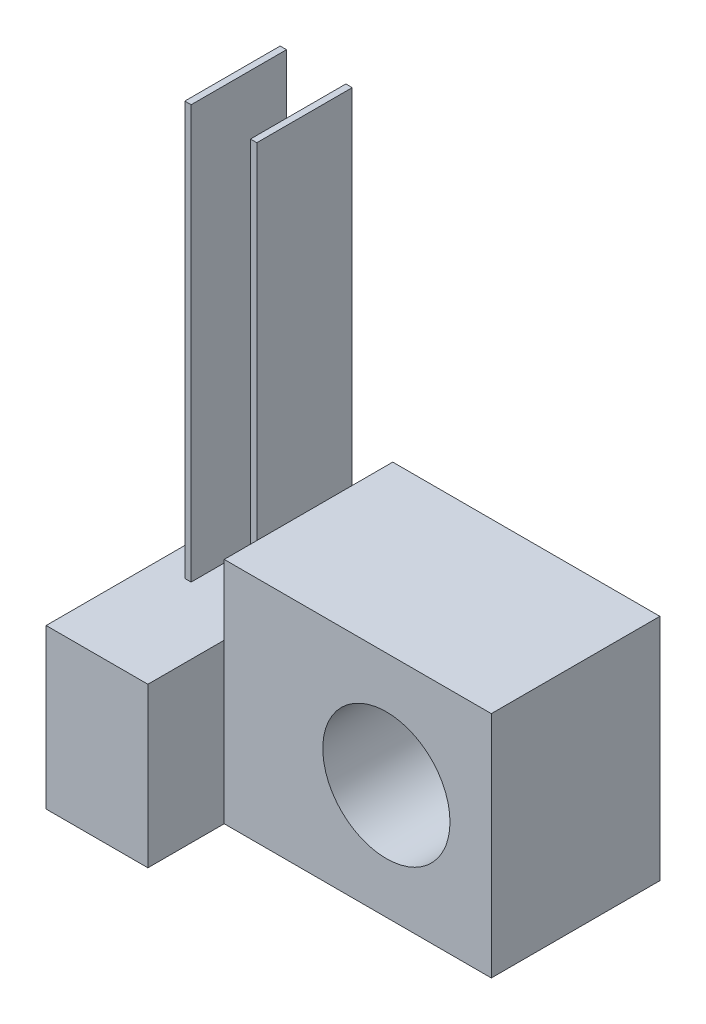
ISO-10303-21;
HEADER;
FILE_DESCRIPTION(('STEP AP214'),'2;1');
FILE_NAME('part.step','',(''),(''),'','','');
FILE_SCHEMA(('AUTOMOTIVE_DESIGN { 1 0 10303 214 1 1 1 1 }'));
ENDSEC;
DATA;
#1=APPLICATION_CONTEXT('core data for automotive mechanical design processes');
#2=APPLICATION_PROTOCOL_DEFINITION('international standard','automotive_design',2000,#1);
#3=PRODUCT_CONTEXT('',#1,'mechanical');
#4=PRODUCT('Part','Part','',(#3));
#5=PRODUCT_RELATED_PRODUCT_CATEGORY('part','',(#4));
#6=PRODUCT_DEFINITION_FORMATION('','',#4);
#7=PRODUCT_DEFINITION_CONTEXT('part definition',#1,'design');
#8=PRODUCT_DEFINITION('design','',#6,#7);
#9=PRODUCT_DEFINITION_SHAPE('','',#8);
#10=(LENGTH_UNIT() NAMED_UNIT(*) SI_UNIT(.MILLI.,.METRE.));
#11=(NAMED_UNIT(*) PLANE_ANGLE_UNIT() SI_UNIT($,.RADIAN.));
#12=(NAMED_UNIT(*) SI_UNIT($,.STERADIAN.) SOLID_ANGLE_UNIT());
#13=UNCERTAINTY_MEASURE_WITH_UNIT(LENGTH_MEASURE(1.E-05),#10,'distance_accuracy_value','');
#14=(GEOMETRIC_REPRESENTATION_CONTEXT(3) GLOBAL_UNCERTAINTY_ASSIGNED_CONTEXT((#13)) GLOBAL_UNIT_ASSIGNED_CONTEXT((#10,
#11,#12)) REPRESENTATION_CONTEXT('',''));
#15=CARTESIAN_POINT('',(0.,0.,0.));
#16=DIRECTION('',(0.,0.,1.));
#17=DIRECTION('',(1.,0.,0.));
#18=AXIS2_PLACEMENT_3D('',#15,#16,#17);
#19=CARTESIAN_POINT('',(9.55,56.6995708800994,-500000.));
#20=DIRECTION('',(0.,1.,0.));
#21=DIRECTION('',(0.,0.,1.));
#22=AXIS2_PLACEMENT_3D('',#19,#20,#21);
#23=PLANE('',#22);
#24=DIRECTION('',(-1.,0.,0.));
#25=VECTOR('',#24,1.);
#26=CARTESIAN_POINT('',(9.53234690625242,56.6995708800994,0.619428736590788));
#27=LINE('',#26,#25);
#28=CARTESIAN_POINT('',(9.53234690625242,56.6995708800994,0.619428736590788));
#29=VERTEX_POINT('',#28);
#30=CARTESIAN_POINT('',(9.43234690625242,56.6995708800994,0.619428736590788));
#31=VERTEX_POINT('',#30);
#32=EDGE_CURVE('E204',#29,#31,#27,.T.);
#33=ORIENTED_EDGE('',*,*,#32,.F.);
#34=DIRECTION('',(0.,0.,-1.));
#35=VECTOR('',#34,1.);
#36=CARTESIAN_POINT('',(9.53234690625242,56.6995708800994,0.619428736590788));
#37=LINE('',#36,#35);
#38=CARTESIAN_POINT('',(9.53234690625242,56.6995708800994,2.11942873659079));
#39=VERTEX_POINT('',#38);
#40=EDGE_CURVE('E173',#39,#29,#37,.T.);
#41=ORIENTED_EDGE('',*,*,#40,.F.);
#42=DIRECTION('',(1.,0.,0.));
#43=VECTOR('',#42,1.);
#44=CARTESIAN_POINT('',(9.53234690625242,56.6995708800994,2.11942873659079));
#45=LINE('',#44,#43);
#46=CARTESIAN_POINT('',(9.43234690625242,56.6995708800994,2.11942873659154));
#47=VERTEX_POINT('',#46);
#48=EDGE_CURVE('E208',#47,#39,#45,.T.);
#49=ORIENTED_EDGE('',*,*,#48,.F.);
#50=DIRECTION('',(0.,0.,1.));
#51=VECTOR('',#50,1.);
#52=CARTESIAN_POINT('',(9.43234690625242,56.6995708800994,0.619428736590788));
#53=LINE('',#52,#51);
#54=EDGE_CURVE('E206',#31,#47,#53,.T.);
#55=ORIENTED_EDGE('',*,*,#54,.F.);
#56=EDGE_LOOP('',(#33,#41,#49,#55));
#57=FACE_BOUND('',#56,.T.);
#58=DIRECTION('',(0.,0.,1.));
#59=VECTOR('',#58,1.);
#60=CARTESIAN_POINT('',(9.55,56.6995708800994,-500000.));
#61=LINE('',#60,#59);
#62=CARTESIAN_POINT('',(9.55,56.6995708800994,0.));
#63=VERTEX_POINT('',#62);
#64=CARTESIAN_POINT('',(9.55,56.6995708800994,2.65));
#65=VERTEX_POINT('',#64);
#66=EDGE_CURVE('E281',#63,#65,#61,.T.);
#67=ORIENTED_EDGE('',*,*,#66,.F.);
#68=DIRECTION('',(-1.,0.,0.));
#69=VECTOR('',#68,1.);
#70=CARTESIAN_POINT('',(9.55,56.6995708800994,0.));
#71=LINE('',#70,#69);
#72=CARTESIAN_POINT('',(7.95,56.6995708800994,0.));
#73=VERTEX_POINT('',#72);
#74=EDGE_CURVE('E378',#63,#73,#71,.T.);
#75=ORIENTED_EDGE('',*,*,#74,.T.);
#76=DIRECTION('',(0.,0.,1.));
#77=VECTOR('',#76,1.);
#78=CARTESIAN_POINT('',(7.95,56.6995708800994,-500000.));
#79=LINE('',#78,#77);
#80=CARTESIAN_POINT('',(7.95,56.6995708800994,3.85));
#81=VERTEX_POINT('',#80);
#82=EDGE_CURVE('E287',#73,#81,#79,.T.);
#83=ORIENTED_EDGE('',*,*,#82,.T.);
#84=DIRECTION('',(-1.,0.,0.));
#85=VECTOR('',#84,1.);
#86=CARTESIAN_POINT('',(9.55,56.6995708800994,3.85));
#87=LINE('',#86,#85);
#88=CARTESIAN_POINT('',(9.55,56.6995708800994,3.85));
#89=VERTEX_POINT('',#88);
#90=EDGE_CURVE('E232',#89,#81,#87,.T.);
#91=ORIENTED_EDGE('',*,*,#90,.F.);
#92=DIRECTION('',(0.,0.,-1.));
#93=VECTOR('',#92,1.);
#94=CARTESIAN_POINT('',(9.55,56.6995708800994,3.85));
#95=LINE('',#94,#93);
#96=EDGE_CURVE('E241',#89,#65,#95,.T.);
#97=ORIENTED_EDGE('',*,*,#96,.T.);
#98=EDGE_LOOP('',(#67,#75,#83,#91,#97));
#99=FACE_BOUND('',#98,.T.);
#100=DIRECTION('',(-1.,0.,0.));
#101=VECTOR('',#100,1.);
#102=CARTESIAN_POINT('',(8.49914891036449,56.6995708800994,0.619428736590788));
#103=LINE('',#102,#101);
#104=CARTESIAN_POINT('',(8.49914891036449,56.6995708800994,0.619428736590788));
#105=VERTEX_POINT('',#104);
#106=CARTESIAN_POINT('',(8.39914891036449,56.6995708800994,0.619428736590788));
#107=VERTEX_POINT('',#106);
#108=EDGE_CURVE('E167',#105,#107,#103,.T.);
#109=ORIENTED_EDGE('',*,*,#108,.F.);
#110=DIRECTION('',(0.,0.,-1.));
#111=VECTOR('',#110,1.);
#112=CARTESIAN_POINT('',(8.49914891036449,56.6995708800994,0.619428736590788));
#113=LINE('',#112,#111);
#114=CARTESIAN_POINT('',(8.49914891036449,56.6995708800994,2.11942873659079));
#115=VERTEX_POINT('',#114);
#116=EDGE_CURVE('E178',#115,#105,#113,.T.);
#117=ORIENTED_EDGE('',*,*,#116,.F.);
#118=DIRECTION('',(1.,0.,0.));
#119=VECTOR('',#118,1.);
#120=CARTESIAN_POINT('',(8.49914891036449,56.6995708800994,2.11942873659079));
#121=LINE('',#120,#119);
#122=CARTESIAN_POINT('',(8.39914891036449,56.6995708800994,2.11942873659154));
#123=VERTEX_POINT('',#122);
#124=EDGE_CURVE('E188',#123,#115,#121,.T.);
#125=ORIENTED_EDGE('',*,*,#124,.F.);
#126=DIRECTION('',(0.,0.,1.));
#127=VECTOR('',#126,1.);
#128=CARTESIAN_POINT('',(8.39914891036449,56.6995708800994,0.619428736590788));
#129=LINE('',#128,#127);
#130=EDGE_CURVE('E186',#107,#123,#129,.T.);
#131=ORIENTED_EDGE('',*,*,#130,.F.);
#132=EDGE_LOOP('',(#109,#117,#125,#131));
#133=FACE_BOUND('',#132,.T.);
#134=ADVANCED_FACE('F49',(#57,#99,#133),#23,.T.);
#135=CARTESIAN_POINT('',(13.75,54.1995708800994,2.65));
#136=DIRECTION('',(0.,0.,-1.));
#137=DIRECTION('',(-1.,0.,0.));
#138=AXIS2_PLACEMENT_3D('',#135,#136,#137);
#139=PLANE('',#138);
#140=CARTESIAN_POINT('',(12.1,55.9995708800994,2.65));
#141=DIRECTION('',(0.,0.,1.));
#142=DIRECTION('',(1.,0.,0.));
#143=AXIS2_PLACEMENT_3D('',#140,#141,#142);
#144=CIRCLE('',#143,1.);
#145=CARTESIAN_POINT('',(13.1,55.9995708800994,2.65));
#146=VERTEX_POINT('',#145);
#147=EDGE_CURVE('E301',#146,#146,#144,.T.);
#148=ORIENTED_EDGE('',*,*,#147,.F.);
#149=EDGE_LOOP('',(#148));
#150=FACE_BOUND('',#149,.T.);
#151=DIRECTION('',(0.,1.,0.));
#152=VECTOR('',#151,1.);
#153=CARTESIAN_POINT('',(9.55,56.6995708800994,2.65));
#154=LINE('',#153,#152);
#155=CARTESIAN_POINT('',(9.55,54.1995708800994,2.65));
#156=VERTEX_POINT('',#155);
#157=EDGE_CURVE('E228',#156,#65,#154,.T.);
#158=ORIENTED_EDGE('',*,*,#157,.F.);
#159=DIRECTION('',(1.,0.,0.));
#160=VECTOR('',#159,1.);
#161=CARTESIAN_POINT('',(13.75,54.1995708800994,2.65));
#162=LINE('',#161,#160);
#163=CARTESIAN_POINT('',(13.75,54.1995708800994,2.65));
#164=VERTEX_POINT('',#163);
#165=EDGE_CURVE('E58',#156,#164,#162,.T.);
#166=ORIENTED_EDGE('',*,*,#165,.T.);
#167=DIRECTION('',(0.,1.,0.));
#168=VECTOR('',#167,1.);
#169=CARTESIAN_POINT('',(13.75,57.7995708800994,2.65));
#170=LINE('',#169,#168);
#171=CARTESIAN_POINT('',(13.75,57.7995708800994,2.65));
#172=VERTEX_POINT('',#171);
#173=EDGE_CURVE('E12',#164,#172,#170,.T.);
#174=ORIENTED_EDGE('',*,*,#173,.T.);
#175=DIRECTION('',(-1.,0.,0.));
#176=VECTOR('',#175,1.);
#177=CARTESIAN_POINT('',(13.75,57.7995708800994,2.65));
#178=LINE('',#177,#176);
#179=CARTESIAN_POINT('',(9.55,57.7995708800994,2.65));
#180=VERTEX_POINT('',#179);
#181=EDGE_CURVE('E277',#172,#180,#178,.T.);
#182=ORIENTED_EDGE('',*,*,#181,.T.);
#183=DIRECTION('',(0.,-1.,0.));
#184=VECTOR('',#183,1.);
#185=CARTESIAN_POINT('',(9.55,57.7995708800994,2.65));
#186=LINE('',#185,#184);
#187=EDGE_CURVE('E247',#180,#65,#186,.T.);
#188=ORIENTED_EDGE('',*,*,#187,.T.);
#189=EDGE_LOOP('',(#158,#166,#174,#182,#188));
#190=FACE_BOUND('',#189,.T.);
#191=ADVANCED_FACE('F272',(#150,#190),#139,.F.);
#192=CARTESIAN_POINT('',(9.1,55.9995708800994,-1.));
#193=DIRECTION('',(0.,0.,1.));
#194=DIRECTION('',(1.,0.,0.));
#195=AXIS2_PLACEMENT_3D('',#192,#193,#194);
#196=PLANE('',#195);
#197=CARTESIAN_POINT('',(9.1,55.9995708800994,-1.));
#198=DIRECTION('',(0.,0.,1.));
#199=DIRECTION('',(1.,0.,0.));
#200=AXIS2_PLACEMENT_3D('',#197,#198,#199);
#201=CIRCLE('',#200,0.500000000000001);
#202=CARTESIAN_POINT('',(9.6,55.9995708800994,-1.));
#203=VERTEX_POINT('',#202);
#204=EDGE_CURVE('E308',#203,#203,#201,.T.);
#205=ORIENTED_EDGE('',*,*,#204,.F.);
#206=EDGE_LOOP('',(#205));
#207=FACE_BOUND('',#206,.T.);
#208=ADVANCED_FACE('F320',(#207),#196,.F.);
#209=CARTESIAN_POINT('',(9.1,55.9995708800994,-1.));
#210=DIRECTION('',(0.,0.,1.));
#211=DIRECTION('',(1.,0.,0.));
#212=AXIS2_PLACEMENT_3D('',#209,#210,#211);
#213=CYLINDRICAL_SURFACE('',#212,0.500000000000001);
#214=ORIENTED_EDGE('',*,*,#204,.T.);
#215=EDGE_LOOP('',(#214));
#216=FACE_BOUND('',#215,.T.);
#217=CARTESIAN_POINT('',(9.1,55.9995708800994,0.));
#218=DIRECTION('',(0.,0.,1.));
#219=DIRECTION('',(1.,0.,0.));
#220=AXIS2_PLACEMENT_3D('',#217,#218,#219);
#221=CIRCLE('',#220,0.500000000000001);
#222=CARTESIAN_POINT('',(9.6,55.9995708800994,0.));
#223=VERTEX_POINT('',#222);
#224=EDGE_CURVE('E243',#223,#223,#221,.T.);
#225=ORIENTED_EDGE('',*,*,#224,.F.);
#226=EDGE_LOOP('',(#225));
#227=FACE_BOUND('',#226,.T.);
#228=ADVANCED_FACE('F318',(#216,#227),#213,.T.);
#229=CARTESIAN_POINT('',(15.,47.2495708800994,0.));
#230=DIRECTION('',(0.,0.,-1.));
#231=DIRECTION('',(-1.,0.,0.));
#232=AXIS2_PLACEMENT_3D('',#229,#230,#231);
#233=PLANE('',#232);
#234=DIRECTION('',(1.,0.,0.));
#235=VECTOR('',#234,1.);
#236=CARTESIAN_POINT('',(13.75,54.1995708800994,0.));
#237=LINE('',#236,#235);
#238=CARTESIAN_POINT('',(7.95,54.1995708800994,0.));
#239=VERTEX_POINT('',#238);
#240=CARTESIAN_POINT('',(13.75,54.1995708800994,0.));
#241=VERTEX_POINT('',#240);
#242=EDGE_CURVE('E381',#239,#241,#237,.T.);
#243=ORIENTED_EDGE('',*,*,#242,.F.);
#244=DIRECTION('',(0.,-1.,0.));
#245=VECTOR('',#244,1.);
#246=CARTESIAN_POINT('',(7.95,56.6995708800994,0.));
#247=LINE('',#246,#245);
#248=EDGE_CURVE('E298',#73,#239,#247,.T.);
#249=ORIENTED_EDGE('',*,*,#248,.F.);
#250=ORIENTED_EDGE('',*,*,#74,.F.);
#251=DIRECTION('',(0.,-1.,0.));
#252=VECTOR('',#251,1.);
#253=CARTESIAN_POINT('',(9.55,57.7995708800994,0.));
#254=LINE('',#253,#252);
#255=CARTESIAN_POINT('',(9.55,57.7995708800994,0.));
#256=VERTEX_POINT('',#255);
#257=EDGE_CURVE('E284',#256,#63,#254,.T.);
#258=ORIENTED_EDGE('',*,*,#257,.F.);
#259=DIRECTION('',(-1.,0.,0.));
#260=VECTOR('',#259,1.);
#261=CARTESIAN_POINT('',(13.75,57.7995708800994,0.));
#262=LINE('',#261,#260);
#263=CARTESIAN_POINT('',(13.75,57.7995708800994,0.));
#264=VERTEX_POINT('',#263);
#265=EDGE_CURVE('E375',#264,#256,#262,.T.);
#266=ORIENTED_EDGE('',*,*,#265,.F.);
#267=DIRECTION('',(0.,1.,0.));
#268=VECTOR('',#267,1.);
#269=CARTESIAN_POINT('',(13.75,57.7995708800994,0.));
#270=LINE('',#269,#268);
#271=EDGE_CURVE('E307',#241,#264,#270,.T.);
#272=ORIENTED_EDGE('',*,*,#271,.F.);
#273=EDGE_LOOP('',(#243,#249,#250,#258,#266,#272));
#274=FACE_BOUND('',#273,.T.);
#275=ORIENTED_EDGE('',*,*,#224,.T.);
#276=EDGE_LOOP('',(#275));
#277=FACE_BOUND('',#276,.T.);
#278=CARTESIAN_POINT('',(12.1,55.9995708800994,0.));
#279=DIRECTION('',(0.,0.,-1.));
#280=DIRECTION('',(-1.,0.,0.));
#281=AXIS2_PLACEMENT_3D('',#278,#279,#280);
#282=CIRCLE('',#281,1.);
#283=CARTESIAN_POINT('',(11.1,55.9995708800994,0.));
#284=VERTEX_POINT('',#283);
#285=EDGE_CURVE('E305',#284,#284,#282,.F.);
#286=ORIENTED_EDGE('',*,*,#285,.T.);
#287=EDGE_LOOP('',(#286));
#288=FACE_BOUND('',#287,.T.);
#289=ADVANCED_FACE('F315',(#274,#277,#288),#233,.T.);
#290=CARTESIAN_POINT('',(12.1,55.9995708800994,-500000.));
#291=DIRECTION('',(0.,0.,1.));
#292=DIRECTION('',(1.,0.,0.));
#293=AXIS2_PLACEMENT_3D('',#290,#291,#292);
#294=CYLINDRICAL_SURFACE('',#293,1.);
#295=ORIENTED_EDGE('',*,*,#285,.F.);
#296=EDGE_LOOP('',(#295));
#297=FACE_BOUND('',#296,.T.);
#298=ORIENTED_EDGE('',*,*,#147,.T.);
#299=EDGE_LOOP('',(#298));
#300=FACE_BOUND('',#299,.T.);
#301=ADVANCED_FACE('F326',(#297,#300),#294,.F.);
#302=CARTESIAN_POINT('',(13.75,57.7995708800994,-500000.));
#303=DIRECTION('',(0.,1.,0.));
#304=DIRECTION('',(0.,0.,1.));
#305=AXIS2_PLACEMENT_3D('',#302,#303,#304);
#306=PLANE('',#305);
#307=DIRECTION('',(0.,0.,1.));
#308=VECTOR('',#307,1.);
#309=CARTESIAN_POINT('',(13.75,57.7995708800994,-500000.));
#310=LINE('',#309,#308);
#311=EDGE_CURVE('E383',#264,#172,#310,.T.);
#312=ORIENTED_EDGE('',*,*,#311,.F.);
#313=ORIENTED_EDGE('',*,*,#265,.T.);
#314=DIRECTION('',(0.,0.,1.));
#315=VECTOR('',#314,1.);
#316=CARTESIAN_POINT('',(9.55,57.7995708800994,-500000.));
#317=LINE('',#316,#315);
#318=EDGE_CURVE('E288',#256,#180,#317,.T.);
#319=ORIENTED_EDGE('',*,*,#318,.T.);
#320=ORIENTED_EDGE('',*,*,#181,.F.);
#321=EDGE_LOOP('',(#312,#313,#319,#320));
#322=FACE_BOUND('',#321,.T.);
#323=ADVANCED_FACE('F361',(#322),#306,.T.);
#324=CARTESIAN_POINT('',(9.55,57.7995708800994,-500000.));
#325=DIRECTION('',(-1.,0.,0.));
#326=DIRECTION('',(0.,0.,1.));
#327=AXIS2_PLACEMENT_3D('',#324,#325,#326);
#328=PLANE('',#327);
#329=ORIENTED_EDGE('',*,*,#318,.F.);
#330=ORIENTED_EDGE('',*,*,#257,.T.);
#331=ORIENTED_EDGE('',*,*,#66,.T.);
#332=ORIENTED_EDGE('',*,*,#187,.F.);
#333=EDGE_LOOP('',(#329,#330,#331,#332));
#334=FACE_BOUND('',#333,.T.);
#335=ADVANCED_FACE('F282',(#334),#328,.T.);
#336=CARTESIAN_POINT('',(13.75,57.7995708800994,-500000.));
#337=DIRECTION('',(1.,0.,0.));
#338=DIRECTION('',(0.,0.,-1.));
#339=AXIS2_PLACEMENT_3D('',#336,#337,#338);
#340=PLANE('',#339);
#341=DIRECTION('',(0.,0.,1.));
#342=VECTOR('',#341,1.);
#343=CARTESIAN_POINT('',(13.75,54.1995708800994,-500000.));
#344=LINE('',#343,#342);
#345=EDGE_CURVE('E269',#241,#164,#344,.T.);
#346=ORIENTED_EDGE('',*,*,#345,.F.);
#347=ORIENTED_EDGE('',*,*,#271,.T.);
#348=ORIENTED_EDGE('',*,*,#311,.T.);
#349=ORIENTED_EDGE('',*,*,#173,.F.);
#350=EDGE_LOOP('',(#346,#347,#348,#349));
#351=FACE_BOUND('',#350,.T.);
#352=ADVANCED_FACE('F345',(#351),#340,.T.);
#353=CARTESIAN_POINT('',(7.95,56.6995708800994,-500000.));
#354=DIRECTION('',(-1.,0.,0.));
#355=DIRECTION('',(0.,0.,1.));
#356=AXIS2_PLACEMENT_3D('',#353,#354,#355);
#357=PLANE('',#356);
#358=ORIENTED_EDGE('',*,*,#82,.F.);
#359=ORIENTED_EDGE('',*,*,#248,.T.);
#360=DIRECTION('',(0.,0.,1.));
#361=VECTOR('',#360,1.);
#362=CARTESIAN_POINT('',(7.95,54.1995708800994,-500000.));
#363=LINE('',#362,#361);
#364=CARTESIAN_POINT('',(7.95,54.1995708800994,3.85));
#365=VERTEX_POINT('',#364);
#366=EDGE_CURVE('E296',#239,#365,#363,.T.);
#367=ORIENTED_EDGE('',*,*,#366,.T.);
#368=DIRECTION('',(0.,-1.,0.));
#369=VECTOR('',#368,1.);
#370=CARTESIAN_POINT('',(7.95,56.6995708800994,3.85));
#371=LINE('',#370,#369);
#372=EDGE_CURVE('E235',#81,#365,#371,.T.);
#373=ORIENTED_EDGE('',*,*,#372,.F.);
#374=EDGE_LOOP('',(#358,#359,#367,#373));
#375=FACE_BOUND('',#374,.T.);
#376=ADVANCED_FACE('F295',(#375),#357,.T.);
#377=CARTESIAN_POINT('',(13.75,54.1995708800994,-500000.));
#378=DIRECTION('',(0.,-1.,0.));
#379=DIRECTION('',(0.,0.,-1.));
#380=AXIS2_PLACEMENT_3D('',#377,#378,#379);
#381=PLANE('',#380);
#382=ORIENTED_EDGE('',*,*,#366,.F.);
#383=ORIENTED_EDGE('',*,*,#242,.T.);
#384=ORIENTED_EDGE('',*,*,#345,.T.);
#385=ORIENTED_EDGE('',*,*,#165,.F.);
#386=DIRECTION('',(0.,0.,-1.));
#387=VECTOR('',#386,1.);
#388=CARTESIAN_POINT('',(9.55,54.1995708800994,3.85));
#389=LINE('',#388,#387);
#390=CARTESIAN_POINT('',(9.55,54.1995708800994,3.85));
#391=VERTEX_POINT('',#390);
#392=EDGE_CURVE('E240',#391,#156,#389,.T.);
#393=ORIENTED_EDGE('',*,*,#392,.F.);
#394=DIRECTION('',(1.,0.,0.));
#395=VECTOR('',#394,1.);
#396=CARTESIAN_POINT('',(9.55,54.1995708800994,3.85));
#397=LINE('',#396,#395);
#398=EDGE_CURVE('E238',#365,#391,#397,.T.);
#399=ORIENTED_EDGE('',*,*,#398,.F.);
#400=EDGE_LOOP('',(#382,#383,#384,#385,#393,#399));
#401=FACE_BOUND('',#400,.T.);
#402=ADVANCED_FACE('F51',(#401),#381,.T.);
#403=CARTESIAN_POINT('',(9.55,56.6995708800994,3.85));
#404=DIRECTION('',(-1.,0.,0.));
#405=DIRECTION('',(0.,0.,1.));
#406=AXIS2_PLACEMENT_3D('',#403,#404,#405);
#407=PLANE('',#406);
#408=ORIENTED_EDGE('',*,*,#157,.T.);
#409=ORIENTED_EDGE('',*,*,#96,.F.);
#410=DIRECTION('',(0.,1.,0.));
#411=VECTOR('',#410,1.);
#412=CARTESIAN_POINT('',(9.55,56.6995708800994,3.85));
#413=LINE('',#412,#411);
#414=EDGE_CURVE('E229',#391,#89,#413,.T.);
#415=ORIENTED_EDGE('',*,*,#414,.F.);
#416=ORIENTED_EDGE('',*,*,#392,.T.);
#417=EDGE_LOOP('',(#408,#409,#415,#416));
#418=FACE_BOUND('',#417,.T.);
#419=ADVANCED_FACE('F260',(#418),#407,.F.);
#420=CARTESIAN_POINT('',(9.55,54.1995708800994,3.85));
#421=DIRECTION('',(0.,0.,-1.));
#422=DIRECTION('',(-1.,0.,0.));
#423=AXIS2_PLACEMENT_3D('',#420,#421,#422);
#424=PLANE('',#423);
#425=ORIENTED_EDGE('',*,*,#414,.T.);
#426=ORIENTED_EDGE('',*,*,#90,.T.);
#427=ORIENTED_EDGE('',*,*,#372,.T.);
#428=ORIENTED_EDGE('',*,*,#398,.T.);
#429=EDGE_LOOP('',(#425,#426,#427,#428));
#430=FACE_BOUND('',#429,.T.);
#431=ADVANCED_FACE('F293',(#430),#424,.F.);
#432=CARTESIAN_POINT('',(9.53234690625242,63.1995708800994,0.619428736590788));
#433=DIRECTION('',(-1.,0.,0.));
#434=DIRECTION('',(0.,0.,1.));
#435=AXIS2_PLACEMENT_3D('',#432,#433,#434);
#436=PLANE('',#435);
#437=ORIENTED_EDGE('',*,*,#40,.T.);
#438=DIRECTION('',(0.,-1.,0.));
#439=VECTOR('',#438,1.);
#440=CARTESIAN_POINT('',(9.53234690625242,63.1995708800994,0.619428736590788));
#441=LINE('',#440,#439);
#442=CARTESIAN_POINT('',(9.53234690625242,63.1995708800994,0.619428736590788));
#443=VERTEX_POINT('',#442);
#444=EDGE_CURVE('E226',#443,#29,#441,.T.);
#445=ORIENTED_EDGE('',*,*,#444,.F.);
#446=DIRECTION('',(0.,0.,-1.));
#447=VECTOR('',#446,1.);
#448=CARTESIAN_POINT('',(9.53234690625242,63.1995708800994,0.619428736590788));
#449=LINE('',#448,#447);
#450=CARTESIAN_POINT('',(9.53234690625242,63.1995708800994,2.11942873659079));
#451=VERTEX_POINT('',#450);
#452=EDGE_CURVE('E210',#451,#443,#449,.T.);
#453=ORIENTED_EDGE('',*,*,#452,.F.);
#454=DIRECTION('',(0.,-1.,0.));
#455=VECTOR('',#454,1.);
#456=CARTESIAN_POINT('',(9.53234690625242,63.1995708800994,2.11942873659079));
#457=LINE('',#456,#455);
#458=EDGE_CURVE('E219',#451,#39,#457,.T.);
#459=ORIENTED_EDGE('',*,*,#458,.T.);
#460=EDGE_LOOP('',(#437,#445,#453,#459));
#461=FACE_BOUND('',#460,.T.);
#462=ADVANCED_FACE('F358',(#461),#436,.F.);
#463=CARTESIAN_POINT('',(9.53234690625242,63.1995708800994,0.619428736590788));
#464=DIRECTION('',(0.,0.,1.));
#465=DIRECTION('',(1.,0.,0.));
#466=AXIS2_PLACEMENT_3D('',#463,#464,#465);
#467=PLANE('',#466);
#468=ORIENTED_EDGE('',*,*,#32,.T.);
#469=DIRECTION('',(0.,-1.,0.));
#470=VECTOR('',#469,1.);
#471=CARTESIAN_POINT('',(9.43234690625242,63.1995708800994,0.619428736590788));
#472=LINE('',#471,#470);
#473=CARTESIAN_POINT('',(9.43234690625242,63.1995708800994,0.619428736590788));
#474=VERTEX_POINT('',#473);
#475=EDGE_CURVE('E223',#474,#31,#472,.T.);
#476=ORIENTED_EDGE('',*,*,#475,.F.);
#477=DIRECTION('',(-1.,0.,0.));
#478=VECTOR('',#477,1.);
#479=CARTESIAN_POINT('',(9.53234690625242,63.1995708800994,0.619428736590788));
#480=LINE('',#479,#478);
#481=EDGE_CURVE('E213',#443,#474,#480,.T.);
#482=ORIENTED_EDGE('',*,*,#481,.F.);
#483=ORIENTED_EDGE('',*,*,#444,.T.);
#484=EDGE_LOOP('',(#468,#476,#482,#483));
#485=FACE_BOUND('',#484,.T.);
#486=ADVANCED_FACE('F427',(#485),#467,.F.);
#487=CARTESIAN_POINT('',(9.43234690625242,63.1995708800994,0.619428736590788));
#488=DIRECTION('',(1.,0.,0.));
#489=DIRECTION('',(0.,0.,-1.));
#490=AXIS2_PLACEMENT_3D('',#487,#488,#489);
#491=PLANE('',#490);
#492=ORIENTED_EDGE('',*,*,#54,.T.);
#493=DIRECTION('',(0.,-1.,0.));
#494=VECTOR('',#493,1.);
#495=CARTESIAN_POINT('',(9.43234690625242,63.1995708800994,2.11942873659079));
#496=LINE('',#495,#494);
#497=CARTESIAN_POINT('',(9.43234690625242,63.1995708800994,2.11942873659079));
#498=VERTEX_POINT('',#497);
#499=EDGE_CURVE('E74',#498,#47,#496,.T.);
#500=ORIENTED_EDGE('',*,*,#499,.F.);
#501=DIRECTION('',(0.,0.,1.));
#502=VECTOR('',#501,1.);
#503=CARTESIAN_POINT('',(9.43234690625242,63.1995708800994,0.619428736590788));
#504=LINE('',#503,#502);
#505=EDGE_CURVE('E215',#474,#498,#504,.T.);
#506=ORIENTED_EDGE('',*,*,#505,.F.);
#507=ORIENTED_EDGE('',*,*,#475,.T.);
#508=EDGE_LOOP('',(#492,#500,#506,#507));
#509=FACE_BOUND('',#508,.T.);
#510=ADVANCED_FACE('F435',(#509),#491,.F.);
#511=CARTESIAN_POINT('',(9.53234690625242,63.1995708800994,2.11942873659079));
#512=DIRECTION('',(0.,0.,-1.));
#513=DIRECTION('',(-1.,0.,0.));
#514=AXIS2_PLACEMENT_3D('',#511,#512,#513);
#515=PLANE('',#514);
#516=ORIENTED_EDGE('',*,*,#48,.T.);
#517=ORIENTED_EDGE('',*,*,#458,.F.);
#518=DIRECTION('',(1.,0.,0.));
#519=VECTOR('',#518,1.);
#520=CARTESIAN_POINT('',(9.53234690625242,63.1995708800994,2.11942873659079));
#521=LINE('',#520,#519);
#522=EDGE_CURVE('E217',#498,#451,#521,.T.);
#523=ORIENTED_EDGE('',*,*,#522,.F.);
#524=ORIENTED_EDGE('',*,*,#499,.T.);
#525=EDGE_LOOP('',(#516,#517,#523,#524));
#526=FACE_BOUND('',#525,.T.);
#527=ADVANCED_FACE('F443',(#526),#515,.F.);
#528=CARTESIAN_POINT('',(9.53234690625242,63.1995708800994,2.11942873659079));
#529=DIRECTION('',(0.,-1.,0.));
#530=DIRECTION('',(0.,0.,-1.));
#531=AXIS2_PLACEMENT_3D('',#528,#529,#530);
#532=PLANE('',#531);
#533=ORIENTED_EDGE('',*,*,#452,.T.);
#534=ORIENTED_EDGE('',*,*,#481,.T.);
#535=ORIENTED_EDGE('',*,*,#505,.T.);
#536=ORIENTED_EDGE('',*,*,#522,.T.);
#537=EDGE_LOOP('',(#533,#534,#535,#536));
#538=FACE_BOUND('',#537,.T.);
#539=ADVANCED_FACE('F451',(#538),#532,.F.);
#540=CARTESIAN_POINT('',(8.49914891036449,63.1995708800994,0.619428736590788));
#541=DIRECTION('',(-1.,0.,0.));
#542=DIRECTION('',(0.,0.,1.));
#543=AXIS2_PLACEMENT_3D('',#540,#541,#542);
#544=PLANE('',#543);
#545=ORIENTED_EDGE('',*,*,#116,.T.);
#546=DIRECTION('',(0.,-1.,0.));
#547=VECTOR('',#546,1.);
#548=CARTESIAN_POINT('',(8.49914891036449,63.1995708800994,0.619428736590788));
#549=LINE('',#548,#547);
#550=CARTESIAN_POINT('',(8.49914891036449,63.1995708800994,0.619428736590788));
#551=VERTEX_POINT('',#550);
#552=EDGE_CURVE('E162',#551,#105,#549,.T.);
#553=ORIENTED_EDGE('',*,*,#552,.F.);
#554=DIRECTION('',(0.,0.,-1.));
#555=VECTOR('',#554,1.);
#556=CARTESIAN_POINT('',(8.49914891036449,63.1995708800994,0.619428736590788));
#557=LINE('',#556,#555);
#558=CARTESIAN_POINT('',(8.49914891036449,63.1995708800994,2.11942873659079));
#559=VERTEX_POINT('',#558);
#560=EDGE_CURVE('E192',#559,#551,#557,.T.);
#561=ORIENTED_EDGE('',*,*,#560,.F.);
#562=DIRECTION('',(0.,-1.,0.));
#563=VECTOR('',#562,1.);
#564=CARTESIAN_POINT('',(8.49914891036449,63.1995708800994,2.11942873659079));
#565=LINE('',#564,#563);
#566=EDGE_CURVE('E181',#559,#115,#565,.T.);
#567=ORIENTED_EDGE('',*,*,#566,.T.);
#568=EDGE_LOOP('',(#545,#553,#561,#567));
#569=FACE_BOUND('',#568,.T.);
#570=ADVANCED_FACE('F179',(#569),#544,.F.);
#571=CARTESIAN_POINT('',(8.49914891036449,63.1995708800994,0.619428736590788));
#572=DIRECTION('',(0.,0.,1.));
#573=DIRECTION('',(1.,0.,0.));
#574=AXIS2_PLACEMENT_3D('',#571,#572,#573);
#575=PLANE('',#574);
#576=ORIENTED_EDGE('',*,*,#108,.T.);
#577=DIRECTION('',(0.,-1.,0.));
#578=VECTOR('',#577,1.);
#579=CARTESIAN_POINT('',(8.39914891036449,63.1995708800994,0.619428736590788));
#580=LINE('',#579,#578);
#581=CARTESIAN_POINT('',(8.39914891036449,63.1995708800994,0.619428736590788));
#582=VERTEX_POINT('',#581);
#583=EDGE_CURVE('E174',#582,#107,#580,.T.);
#584=ORIENTED_EDGE('',*,*,#583,.F.);
#585=DIRECTION('',(-1.,0.,0.));
#586=VECTOR('',#585,1.);
#587=CARTESIAN_POINT('',(8.49914891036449,63.1995708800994,0.619428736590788));
#588=LINE('',#587,#586);
#589=EDGE_CURVE('E169',#551,#582,#588,.T.);
#590=ORIENTED_EDGE('',*,*,#589,.F.);
#591=ORIENTED_EDGE('',*,*,#552,.T.);
#592=EDGE_LOOP('',(#576,#584,#590,#591));
#593=FACE_BOUND('',#592,.T.);
#594=ADVANCED_FACE('F164',(#593),#575,.F.);
#595=CARTESIAN_POINT('',(8.39914891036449,63.1995708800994,0.619428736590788));
#596=DIRECTION('',(1.,0.,0.));
#597=DIRECTION('',(0.,0.,-1.));
#598=AXIS2_PLACEMENT_3D('',#595,#596,#597);
#599=PLANE('',#598);
#600=ORIENTED_EDGE('',*,*,#130,.T.);
#601=DIRECTION('',(0.,-1.,0.));
#602=VECTOR('',#601,1.);
#603=CARTESIAN_POINT('',(8.39914891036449,63.1995708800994,2.11942873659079));
#604=LINE('',#603,#602);
#605=CARTESIAN_POINT('',(8.39914891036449,63.1995708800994,2.11942873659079));
#606=VERTEX_POINT('',#605);
#607=EDGE_CURVE('E66',#606,#123,#604,.T.);
#608=ORIENTED_EDGE('',*,*,#607,.F.);
#609=DIRECTION('',(0.,0.,1.));
#610=VECTOR('',#609,1.);
#611=CARTESIAN_POINT('',(8.39914891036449,63.1995708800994,0.619428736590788));
#612=LINE('',#611,#610);
#613=EDGE_CURVE('E195',#582,#606,#612,.T.);
#614=ORIENTED_EDGE('',*,*,#613,.F.);
#615=ORIENTED_EDGE('',*,*,#583,.T.);
#616=EDGE_LOOP('',(#600,#608,#614,#615));
#617=FACE_BOUND('',#616,.T.);
#618=ADVANCED_FACE('F471',(#617),#599,.F.);
#619=CARTESIAN_POINT('',(8.49914891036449,63.1995708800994,2.11942873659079));
#620=DIRECTION('',(0.,0.,-1.));
#621=DIRECTION('',(-1.,0.,0.));
#622=AXIS2_PLACEMENT_3D('',#619,#620,#621);
#623=PLANE('',#622);
#624=ORIENTED_EDGE('',*,*,#124,.T.);
#625=ORIENTED_EDGE('',*,*,#566,.F.);
#626=DIRECTION('',(1.,0.,0.));
#627=VECTOR('',#626,1.);
#628=CARTESIAN_POINT('',(8.49914891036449,63.1995708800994,2.11942873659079));
#629=LINE('',#628,#627);
#630=EDGE_CURVE('E197',#606,#559,#629,.T.);
#631=ORIENTED_EDGE('',*,*,#630,.F.);
#632=ORIENTED_EDGE('',*,*,#607,.T.);
#633=EDGE_LOOP('',(#624,#625,#631,#632));
#634=FACE_BOUND('',#633,.T.);
#635=ADVANCED_FACE('F478',(#634),#623,.F.);
#636=CARTESIAN_POINT('',(8.49914891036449,63.1995708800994,2.11942873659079));
#637=DIRECTION('',(0.,-1.,0.));
#638=DIRECTION('',(0.,0.,-1.));
#639=AXIS2_PLACEMENT_3D('',#636,#637,#638);
#640=PLANE('',#639);
#641=ORIENTED_EDGE('',*,*,#560,.T.);
#642=ORIENTED_EDGE('',*,*,#589,.T.);
#643=ORIENTED_EDGE('',*,*,#613,.T.);
#644=ORIENTED_EDGE('',*,*,#630,.T.);
#645=EDGE_LOOP('',(#641,#642,#643,#644));
#646=FACE_BOUND('',#645,.T.);
#647=ADVANCED_FACE('F486',(#646),#640,.F.);
#648=CLOSED_SHELL('',(#134,#191,#208,#228,#289,#301,#323,#335,#352,#376,#402,#419,#431,#462,
#486,#510,#527,#539,#570,#594,#618,#635,#647));
#649=MANIFOLD_SOLID_BREP('B2',#648);
#650=ADVANCED_BREP_SHAPE_REPRESENTATION('',(#18,#649),#14);
#651=SHAPE_DEFINITION_REPRESENTATION(#9,#650);
ENDSEC;
END-ISO-10303-21;
